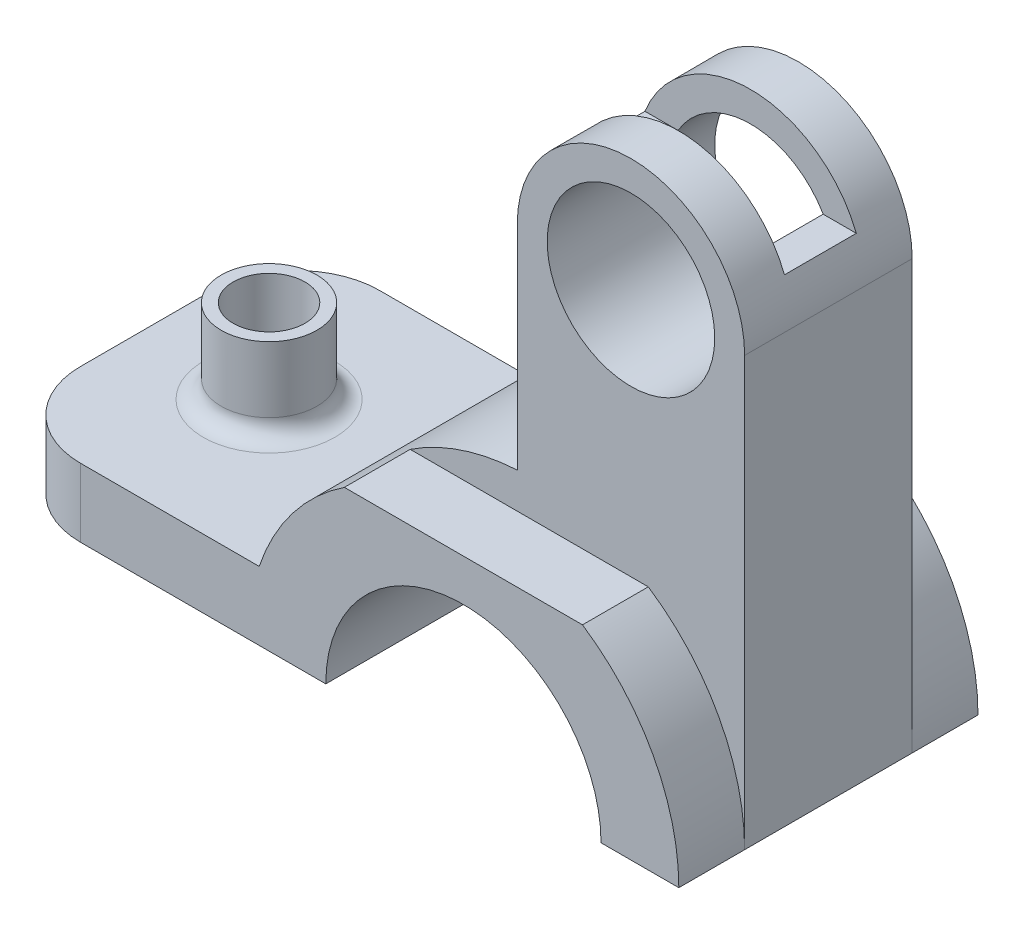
from build123d import *

# Parameters (mm, degrees)
BOSS_EXTRUDE1_DEPTH = 25
SKETCH2_R           = 14
BOSS_EXTRUDE2_DEPTH = 14
SKETCH3_W           = 77.811322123
SKETCH3_H           = 16.742190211
CUT_EXTRUDE1_DEPTH  = 11
SKETCH5_W           = 78.689202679
SKETCH5_H           = 15.020932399
CUT_EXTRUDE2_DEPTH  = 11
SKETCH6_R           = 8
BOSS_EXTRUDE3_DEPTH = 14
SKETCH7_R           = 6
CUT_EXTRUDE3_DEPTH  = 30
FILLET1_R           = 14
FILLET2_R           = 3
SKETCH8_W           = 12
SKETCH8_H           = 12
CUT_EXTRUDE4_DEPTH  = 41


with BuildPart() as part:
    # Sketch1 → Boss-Extrude1 (new, symmetric)
    with BuildSketch(Plane.XY):
        with BuildLine():
            Line((-36, 0), (-78, 0))
            Line((-78, 0), (-78, 11.44121156))
            Line((-78, 11.44121156), (-34.133541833, 11.44121156))
            ThreePointArc((-34.133541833, 11.44121156), (5.796226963, 35.5303216), (36, 0))
            Line((36, 0), (23, 0))
            ThreePointArc((23, 0), (0, 23), (-23, 0))
            Line((-23, 0), (-36, 0))
        make_face()
    extrude(amount=BOSS_EXTRUDE1_DEPTH, both=True)

    # Sketch2 → Boss-Extrude2 (add, symmetric)
    with BuildSketch(Plane.XY):
        with BuildLine():
            ThreePointArc((-2, 35.944401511), (24.738633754, 26.153393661), (36, 0))
            Line((36, 0), (36, 71.547298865))
            ThreePointArc((36, 71.547298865), (17, 90.547298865), (-2, 71.547298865))
            Line((-2, 71.547298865), (-2, 35.944401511))
        make_face()
        with Locations((17, 71.547298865)):
            Circle(SKETCH2_R, mode=Mode.SUBTRACT)
    extrude(amount=BOSS_EXTRUDE2_DEPTH, both=True)

    # Sketch3 → Cut-Extrude1 (cut)
    with BuildSketch(Plane.XY.offset(25)):
        with Locations((4.938680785, 38.371095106)):
            Rectangle(SKETCH3_W, SKETCH3_H)
    extrude(amount=-CUT_EXTRUDE1_DEPTH, mode=Mode.SUBTRACT)

    # Sketch5 → Cut-Extrude2 (cut)
    with BuildSketch(Plane(origin=(0, 0, -25), x_dir=(-1, 0, 0), z_dir=(0, 0, -1))):
        with Locations((-10.39574331, 37.5104662)):
            Rectangle(SKETCH5_W, SKETCH5_H)
    extrude(amount=-CUT_EXTRUDE2_DEPTH, mode=Mode.SUBTRACT)

    # Sketch6 → Boss-Extrude3 (add)
    with BuildSketch(Plane(origin=(0, 11.44121156, 0), x_dir=(1, 0, 0), z_dir=(0, 1, 0))):
        with Locations((-57.485329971, 0)):
            Circle(SKETCH6_R)
    extrude(amount=BOSS_EXTRUDE3_DEPTH)

    # Sketch7 → Cut-Extrude3 (cut)
    with BuildSketch(Plane(origin=(0, 25.44121156, 0), x_dir=(1, 0, 0), z_dir=(0, 1, 0))):
        with Locations(Location((-57.485329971, 0, 0), (0, 0, 180))):
            Circle(SKETCH7_R)
    extrude(amount=-CUT_EXTRUDE3_DEPTH, mode=Mode.SUBTRACT)

    # Fillet1
    fillet1_edges = [part.edges().sort_by_distance(p)[0] for p in [
        (-78, 5.72060578, 25),
        (-78, 5.72060578, -25),
    ]]
    fillet(fillet1_edges, radius=FILLET1_R)

    # Fillet2
    fillet2_edges = [part.edges().sort_by_distance(p)[0] for p in [
        (-65.485329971, 11.44121156, 0),
    ]]
    fillet(fillet2_edges, radius=FILLET2_R)

    # Sketch8 → Cut-Extrude4 (cut)
    with BuildSketch(Plane(origin=(36, 0, 0), x_dir=(0, 0, -1), z_dir=(1, 0, 0))):
        with Locations((0, 84.547298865)):
            Rectangle(SKETCH8_W, SKETCH8_H)
    extrude(amount=-CUT_EXTRUDE4_DEPTH, mode=Mode.SUBTRACT)


solid = part.part
